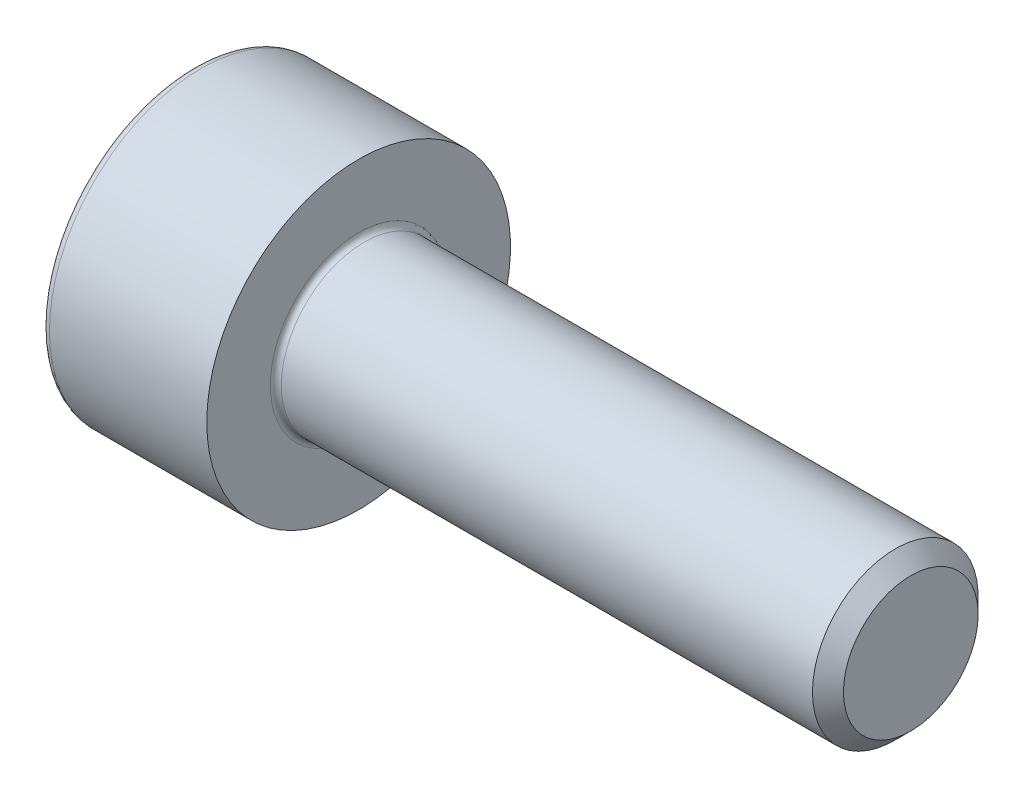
from build123d import *

# Parameters (mm, degrees)
FILLET1_R   = 0.1
FILLET2_R   = 0.15
HEX_2_DEPTH = 1.3


with BuildPart() as part:
    # BodySke → Base-Revolve (revolve)
    with BuildSketch(Plane.XY, mode=Mode.PRIVATE) as base_revolve_sk:
        Polygon((0, 0), (0, 2.75), (3, 2.75), (3, 1.5), (12.7195, 1.5), (13, 1.2195), (13, 0), align=None)
    revolve(base_revolve_sk.sketch.rotate(Axis((-31.75, 0, 0), (1, 0, 0)), 90), axis=Axis((-31.75, 0, 0), (1, 0, 0)))

    # Fillet1
    fillet1_edges = [part.edges().sort_by_distance(p)[0] for p in [
        (3, 0, -1.5),
    ]]
    fillet(fillet1_edges, radius=FILLET1_R)

    # Fillet2
    fillet2_edges = [part.edges().sort_by_distance(p)[0] for p in [
        (0, 0, -2.75),
    ]]
    fillet(fillet2_edges, radius=FILLET2_R)

    # Sketch2 → Hex-PreBroach (revolve, cut)
    with BuildSketch(Plane.XY, mode=Mode.PRIVATE) as hex_prebroach_sk:
        Polygon((0, 1.28), (1.3, 1.28), (2.039008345, 0), (0, 0), align=None)
    revolve(hex_prebroach_sk.sketch.rotate(Axis((0, 0, 0), (1, 0, 0)), 90), axis=Axis((0, 0, 0), (1, 0, 0)), mode=Mode.SUBTRACT)

    # Sketch3 → Hex 2 (cut)
    with BuildSketch(Plane(origin=(0, 0, 0), x_dir=(0, 0.500000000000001, 0.866025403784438), z_dir=(-1, 0, 0))):
        Polygon((0.739008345, 1.28), (-0.739008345, 1.28), (-1.478016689, 0), (-0.739008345, -1.28), (0.739008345, -1.28), (1.478016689, 0), align=None)
    extrude(amount=-HEX_2_DEPTH, mode=Mode.SUBTRACT)


solid = part.part
